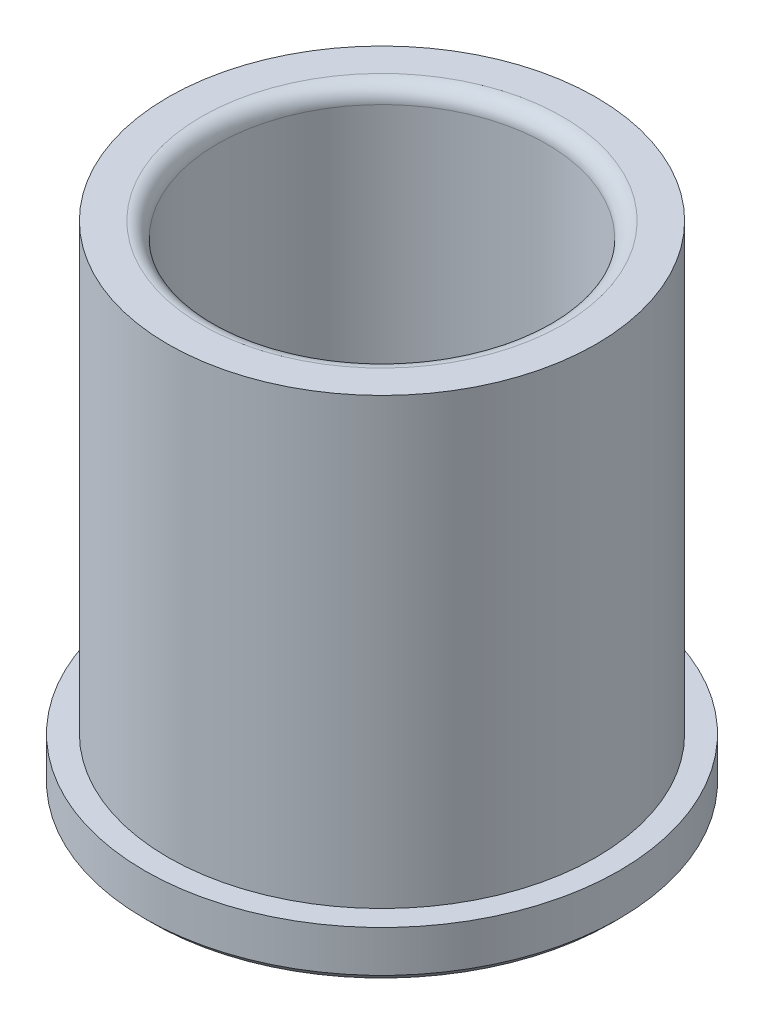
from build123d import *

# Parameters (mm, degrees)
FILLET1_R = 1.524


with BuildPart() as part:
    # Sketch1 → Revolve1 (revolve)
    with BuildSketch(Plane.XY, mode=Mode.PRIVATE) as revolve1_sk:
        Polygon((-22.1234, 0), (-22.8854, 0.762), (-22.8854, 4.7625), (-20.64385, 4.7625), (-20.64385, 47.625), (-15.88135, 47.625), (-15.88135, 0.762), (-16.64335, 0), align=None)
    revolve(revolve1_sk.sketch.rotate(Axis((0, -1000, 0), (0, 1, 0)), 180), axis=Axis((0, -1000, 0), (0, 1, 0)))

    # Fillet1
    fillet1_edges = [part.edges().sort_by_distance(p)[0] for p in [
        (-15.88135, 47.625, 0),
    ]]
    fillet(fillet1_edges, radius=FILLET1_R)


solid = part.part
